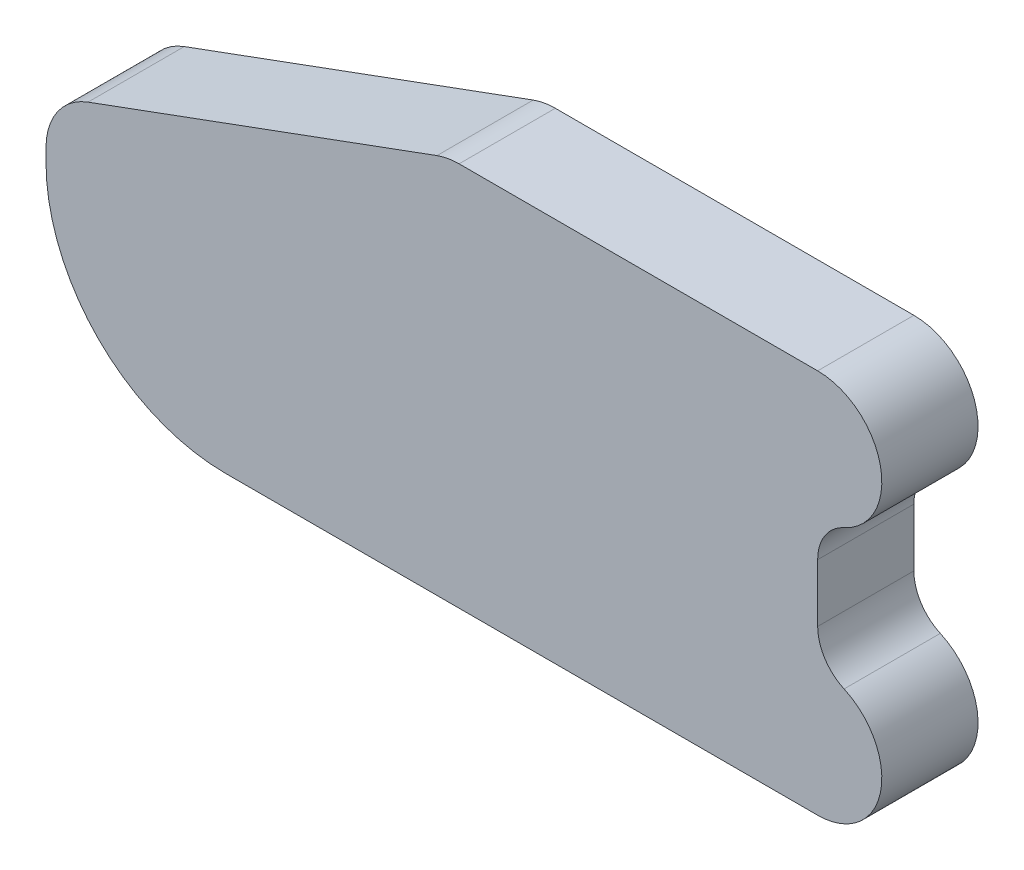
from build123d import *

# Parameters (mm, degrees)
BASE_EXTRUSION_DEPTH = 15


with BuildPart() as part:
    # Esquisse1 → Base-Extrusion (new body)
    with BuildSketch(Plane.XY):
        with BuildLine():
            Line((-119.047663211, 59.386885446), (-173.447663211, 39.406575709))
            ThreePointArc((-173.447663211, 39.406575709), (-178.19989732, 35.743472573), (-180, 30.019690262))
            Line((-180, 30.019690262), (-180, 28))
            ThreePointArc((-180, 28), (-171.798989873, 8.201010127), (-152, 0))
            Line((-152, 0), (-59.7, 0))
            ThreePointArc((-59.7, 0), (-49.924289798, 7.893939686), (-55.582352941, 19.112901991))
            ThreePointArc((-55.582352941, 19.112901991), (-58.581176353, 21.695650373), (-59.7, 25.491933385))
            Line((-59.7, 25.491933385), (-59.7, 34.508066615))
            ThreePointArc((-59.7, 34.508066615), (-58.581176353, 38.304349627), (-55.582352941, 40.887098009))
            ThreePointArc((-55.582352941, 40.887098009), (-49.924289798, 52.106060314), (-59.7, 60))
            Line((-59.7, 60), (-115.6, 60))
            ThreePointArc((-115.6, 60), (-117.350877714, 59.845528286), (-119.047663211, 59.386885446))
        make_face()
    extrude(amount=BASE_EXTRUSION_DEPTH)


solid = part.part
